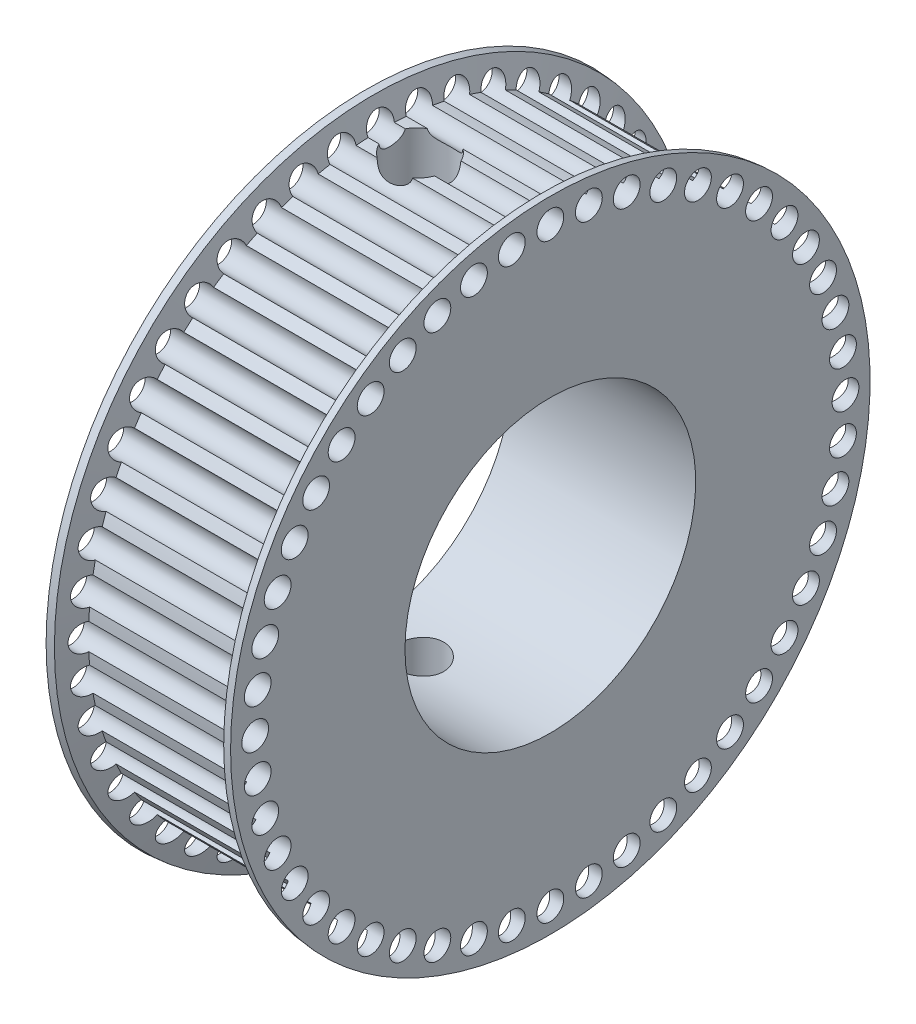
from build123d import *

# Parameters (mm, degrees)
SKETCH3_R          = 2.7686
CUT_EXTRUDE2_DEPTH = 101.86710663
CIRPATTERN1_COUNT  = 48
SKETCH5_R          = 3.175
CUT_EXTRUDE3_DEPTH = 149.893621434
SKETCH6_R          = 4.8895
CUT_EXTRUDE4_DEPTH = 120.65
SKETCH8_R          = 6.35
CUT_EXTRUDE5_DEPTH = 19.05


with BuildPart() as part:
    # Sketch1 → Revolve2 (revolve)
    with BuildSketch(Plane.XY, mode=Mode.PRIVATE) as revolve2_sk:
        Polygon((-19.05, 30.0228), (19.05, 30.0228), (19.05, 66.04), (17.482194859, 65.891736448), (15.875, 60.452), (-15.875, 60.452), (-17.482194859, 65.891736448), (-19.05, 66.04), align=None)
    revolve(revolve2_sk.sketch.rotate(Axis((-51.416444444, 0, 0), (1, 0, 0)), 90), axis=Axis((-51.416444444, 0, 0), (1, 0, 0)))

    # Sketch3 → Cut-Extrude2 (cut, through all)
    with BuildSketch(Plane(origin=(19.05, 0, 0), x_dir=(0, 0, -1), z_dir=(1, 0, 0))):
        with Locations((0, 60.96)):
            Circle(SKETCH3_R)
    cut_extrude2 = extrude(amount=-CUT_EXTRUDE2_DEPTH, mode=Mode.SUBTRACT)

    # CirPattern1: Cut-Extrude2 ×48 about axis
    cirpattern1_axis = Axis((0, 0, 0), (1, 0, 0))
    for i in range(1, CIRPATTERN1_COUNT):
        add(cut_extrude2.rotate(cirpattern1_axis, i * 360 / CIRPATTERN1_COUNT), mode=Mode.SUBTRACT)

    # Sketch5 → Cut-Extrude3 (cut, through all)
    with BuildSketch(Plane(origin=(0, 66.04, 0), x_dir=(-1, 0, 0), z_dir=(0, 1, 0))):
        with Locations(Location((7.9248, 0, 0), (0, 0, 90))):
            Circle(SKETCH5_R)
    extrude(amount=-CUT_EXTRUDE3_DEPTH, mode=Mode.SUBTRACT)

    # Sketch6 → Cut-Extrude4 (cut)
    with BuildSketch(Plane(origin=(0, 66.04, 0), x_dir=(-1, 0, 0), z_dir=(0, 1, 0))):
        with Locations(Location((7.874, 0, 0), (0, 0, 90))):
            Circle(SKETCH6_R)
    extrude(amount=-CUT_EXTRUDE4_DEPTH, mode=Mode.SUBTRACT)

    # Sketch8 → Cut-Extrude5 (cut)
    with BuildSketch(Plane(origin=(0, 66.04, 0), x_dir=(-1, 0, 0), z_dir=(0, 1, 0))):
        with Locations(Location((7.874, 0, 0), (0, 0, 90))):
            Circle(SKETCH8_R)
    extrude(amount=-CUT_EXTRUDE5_DEPTH, mode=Mode.SUBTRACT)


solid = part.part
